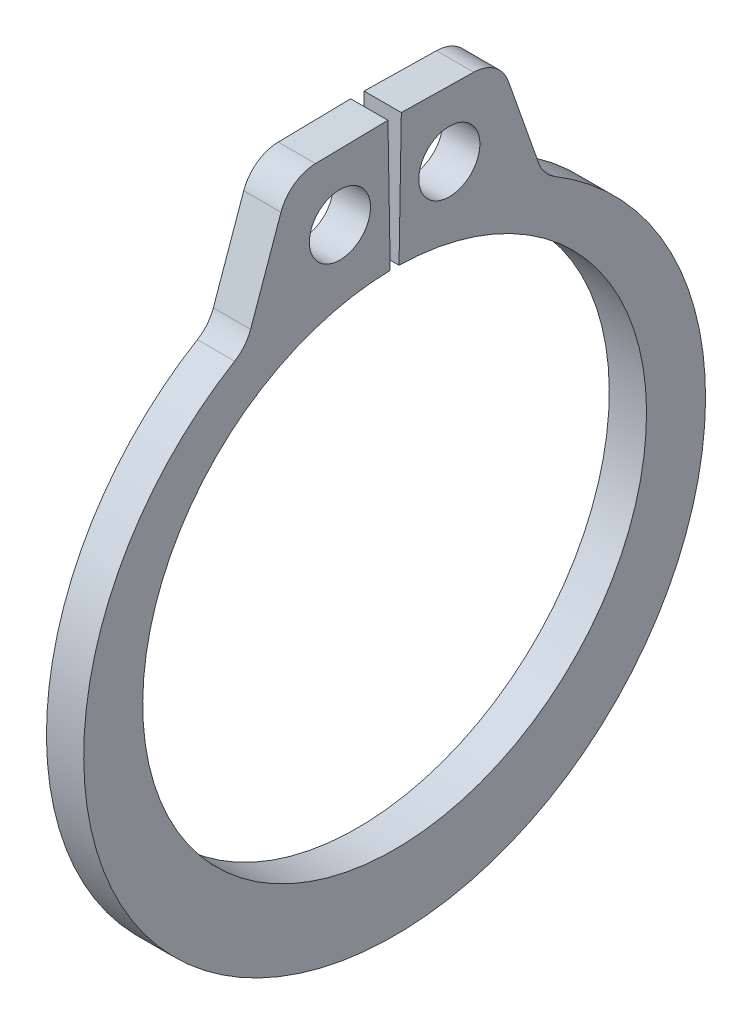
from build123d import *

# Parameters (mm, degrees)
SKETCH1_R      = 0.5207
EXTRUDE1_DEPTH = 0.3175
FILLET1_R      = 0.635


with BuildPart() as part:
    # Sketch1 → Extrude1 (new, symmetric)
    with BuildSketch(Plane(origin=(0, 0, 0), x_dir=(0, 0, -1), z_dir=(1, 0, 0))):
        with BuildLine():
            Line((-0.0749162, 4.291946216), (-0.113925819, 6.526805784))
            Line((-0.113925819, 6.526805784), (-1.790070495, 6.49754857))
            Line((-1.790070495, 6.49754857), (-2.532309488, 4.3891842))
            ThreePointArc((-2.532309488, 4.3891842), (0, -5.5626), (2.532309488, 4.3891842))
            Line((2.532309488, 4.3891842), (1.790070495, 6.49754857))
            Line((1.790070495, 6.49754857), (0.113925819, 6.526805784))
            Line((0.113925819, 6.526805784), (0.0749162, 4.291946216))
            ThreePointArc((0.0749162, 4.291946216), (0, -4.2926), (-0.0749162, 4.291946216))
        make_face()
        with Locations((-0.932493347, 5.394747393)):
            Circle(SKETCH1_R, mode=Mode.SUBTRACT)
        with Locations((0.932493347, 5.394747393)):
            Circle(SKETCH1_R, mode=Mode.SUBTRACT)
    extrude(amount=EXTRUDE1_DEPTH, both=True)

    # Fillet1
    fillet1_edges = [part.edges().sort_by_distance(p)[0] for p in [
        (0, 6.49754857, -1.790070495),
        (0, 4.3891842, -2.532309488),
        (0, 4.3891842, 2.532309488),
        (0, 6.49754857, 1.790070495),
    ]]
    fillet(fillet1_edges, radius=FILLET1_R)


solid = part.part
